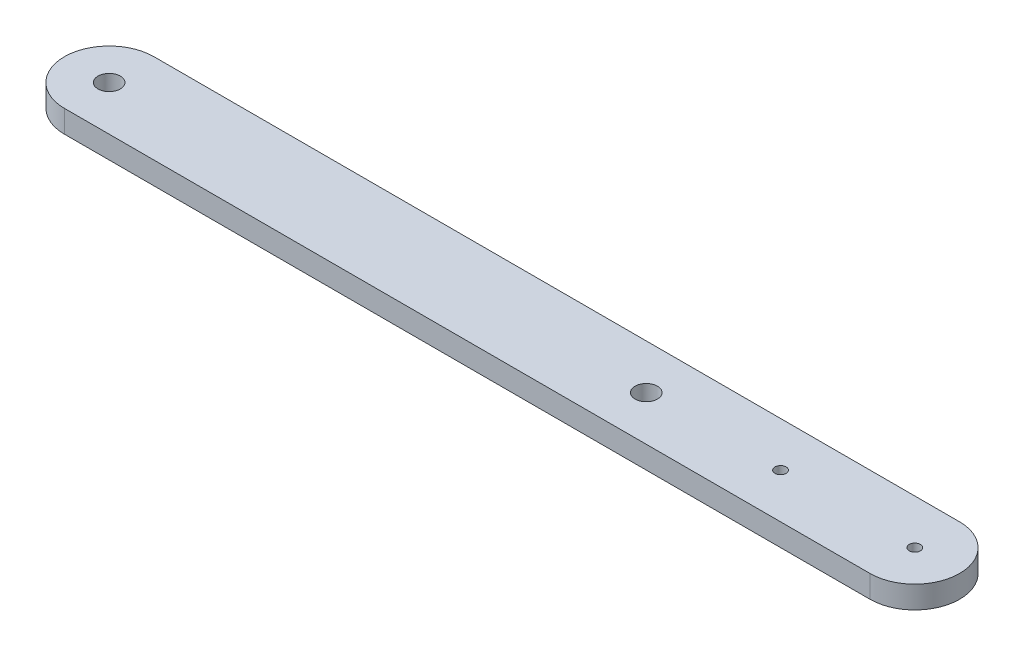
ISO-10303-21;
HEADER;
FILE_DESCRIPTION(('STEP AP214'),'2;1');
FILE_NAME('part.step','',(''),(''),'','','');
FILE_SCHEMA(('AUTOMOTIVE_DESIGN { 1 0 10303 214 1 1 1 1 }'));
ENDSEC;
DATA;
#1=APPLICATION_CONTEXT('core data for automotive mechanical design processes');
#2=APPLICATION_PROTOCOL_DEFINITION('international standard','automotive_design',2000,#1);
#3=PRODUCT_CONTEXT('',#1,'mechanical');
#4=PRODUCT('Part','Part','',(#3));
#5=PRODUCT_RELATED_PRODUCT_CATEGORY('part','',(#4));
#6=PRODUCT_DEFINITION_FORMATION('','',#4);
#7=PRODUCT_DEFINITION_CONTEXT('part definition',#1,'design');
#8=PRODUCT_DEFINITION('design','',#6,#7);
#9=PRODUCT_DEFINITION_SHAPE('','',#8);
#10=(LENGTH_UNIT() NAMED_UNIT(*) SI_UNIT(.MILLI.,.METRE.));
#11=(NAMED_UNIT(*) PLANE_ANGLE_UNIT() SI_UNIT($,.RADIAN.));
#12=(NAMED_UNIT(*) SI_UNIT($,.STERADIAN.) SOLID_ANGLE_UNIT());
#13=UNCERTAINTY_MEASURE_WITH_UNIT(LENGTH_MEASURE(1.E-05),#10,'distance_accuracy_value','');
#14=(GEOMETRIC_REPRESENTATION_CONTEXT(3) GLOBAL_UNCERTAINTY_ASSIGNED_CONTEXT((#13)) GLOBAL_UNIT_ASSIGNED_CONTEXT((#10,
#11,#12)) REPRESENTATION_CONTEXT('',''));
#15=CARTESIAN_POINT('',(0.,0.,0.));
#16=DIRECTION('',(0.,0.,1.));
#17=DIRECTION('',(1.,0.,0.));
#18=AXIS2_PLACEMENT_3D('',#15,#16,#17);
#19=CARTESIAN_POINT('',(0.,6.35,0.));
#20=DIRECTION('',(0.,-1.,0.));
#21=DIRECTION('',(0.,0.,-1.));
#22=AXIS2_PLACEMENT_3D('',#19,#20,#21);
#23=CYLINDRICAL_SURFACE('',#22,12.7);
#24=CARTESIAN_POINT('',(0.,0.,0.));
#25=DIRECTION('',(0.,1.,0.));
#26=DIRECTION('',(0.,0.,1.));
#27=AXIS2_PLACEMENT_3D('',#24,#25,#26);
#28=CIRCLE('',#27,12.7);
#29=CARTESIAN_POINT('',(0.,0.,-12.7));
#30=VERTEX_POINT('',#29);
#31=CARTESIAN_POINT('',(0.,0.,12.7));
#32=VERTEX_POINT('',#31);
#33=EDGE_CURVE('E105',#30,#32,#28,.T.);
#34=ORIENTED_EDGE('',*,*,#33,.T.);
#35=DIRECTION('',(0.,-1.,0.));
#36=VECTOR('',#35,1.);
#37=CARTESIAN_POINT('',(0.,6.35,12.7));
#38=LINE('',#37,#36);
#39=CARTESIAN_POINT('',(0.,6.35,12.7));
#40=VERTEX_POINT('',#39);
#41=EDGE_CURVE('E11',#40,#32,#38,.T.);
#42=ORIENTED_EDGE('',*,*,#41,.F.);
#43=CARTESIAN_POINT('',(0.,6.35,0.));
#44=DIRECTION('',(0.,1.,0.));
#45=DIRECTION('',(0.,0.,1.));
#46=AXIS2_PLACEMENT_3D('',#43,#44,#45);
#47=CIRCLE('',#46,12.7);
#48=CARTESIAN_POINT('',(0.,6.35,-12.7));
#49=VERTEX_POINT('',#48);
#50=EDGE_CURVE('E85',#49,#40,#47,.T.);
#51=ORIENTED_EDGE('',*,*,#50,.F.);
#52=DIRECTION('',(0.,-1.,0.));
#53=VECTOR('',#52,1.);
#54=CARTESIAN_POINT('',(0.,6.35,-12.7));
#55=LINE('',#54,#53);
#56=EDGE_CURVE('E51',#49,#30,#55,.T.);
#57=ORIENTED_EDGE('',*,*,#56,.T.);
#58=EDGE_LOOP('',(#34,#42,#51,#57));
#59=FACE_BOUND('',#58,.T.);
#60=ADVANCED_FACE('F34',(#59),#23,.T.);
#61=CARTESIAN_POINT('',(0.,6.35,12.7));
#62=DIRECTION('',(0.,0.,-1.));
#63=DIRECTION('',(-1.,0.,0.));
#64=AXIS2_PLACEMENT_3D('',#61,#62,#63);
#65=PLANE('',#64);
#66=DIRECTION('',(1.,0.,0.));
#67=VECTOR('',#66,1.);
#68=CARTESIAN_POINT('',(0.,0.,12.7));
#69=LINE('',#68,#67);
#70=CARTESIAN_POINT('',(228.6,0.,12.7));
#71=VERTEX_POINT('',#70);
#72=EDGE_CURVE('E90',#32,#71,#69,.T.);
#73=ORIENTED_EDGE('',*,*,#72,.T.);
#74=DIRECTION('',(0.,-1.,0.));
#75=VECTOR('',#74,1.);
#76=CARTESIAN_POINT('',(228.6,6.35,12.7));
#77=LINE('',#76,#75);
#78=CARTESIAN_POINT('',(228.6,6.35,12.7));
#79=VERTEX_POINT('',#78);
#80=EDGE_CURVE('E43',#79,#71,#77,.T.);
#81=ORIENTED_EDGE('',*,*,#80,.F.);
#82=DIRECTION('',(1.,0.,0.));
#83=VECTOR('',#82,1.);
#84=CARTESIAN_POINT('',(0.,6.35,12.7));
#85=LINE('',#84,#83);
#86=EDGE_CURVE('E77',#40,#79,#85,.T.);
#87=ORIENTED_EDGE('',*,*,#86,.F.);
#88=ORIENTED_EDGE('',*,*,#41,.T.);
#89=EDGE_LOOP('',(#73,#81,#87,#88));
#90=FACE_BOUND('',#89,.T.);
#91=ADVANCED_FACE('F89',(#90),#65,.F.);
#92=CARTESIAN_POINT('',(228.6,6.35,0.));
#93=DIRECTION('',(0.,-1.,0.));
#94=DIRECTION('',(0.,0.,-1.));
#95=AXIS2_PLACEMENT_3D('',#92,#93,#94);
#96=CYLINDRICAL_SURFACE('',#95,12.7);
#97=CARTESIAN_POINT('',(228.6,0.,0.));
#98=DIRECTION('',(0.,1.,0.));
#99=DIRECTION('',(0.,0.,1.));
#100=AXIS2_PLACEMENT_3D('',#97,#98,#99);
#101=CIRCLE('',#100,12.7);
#102=CARTESIAN_POINT('',(228.6,0.,-12.7));
#103=VERTEX_POINT('',#102);
#104=EDGE_CURVE('E109',#71,#103,#101,.T.);
#105=ORIENTED_EDGE('',*,*,#104,.T.);
#106=DIRECTION('',(0.,-1.,0.));
#107=VECTOR('',#106,1.);
#108=CARTESIAN_POINT('',(228.6,6.35,-12.7));
#109=LINE('',#108,#107);
#110=CARTESIAN_POINT('',(228.6,6.35,-12.7));
#111=VERTEX_POINT('',#110);
#112=EDGE_CURVE('E66',#111,#103,#109,.T.);
#113=ORIENTED_EDGE('',*,*,#112,.F.);
#114=CARTESIAN_POINT('',(228.6,6.35,0.));
#115=DIRECTION('',(0.,1.,0.));
#116=DIRECTION('',(0.,0.,1.));
#117=AXIS2_PLACEMENT_3D('',#114,#115,#116);
#118=CIRCLE('',#117,12.7);
#119=EDGE_CURVE('E84',#79,#111,#118,.T.);
#120=ORIENTED_EDGE('',*,*,#119,.F.);
#121=ORIENTED_EDGE('',*,*,#80,.T.);
#122=EDGE_LOOP('',(#105,#113,#120,#121));
#123=FACE_BOUND('',#122,.T.);
#124=ADVANCED_FACE('F93',(#123),#96,.T.);
#125=CARTESIAN_POINT('',(0.,6.35,-12.7));
#126=DIRECTION('',(0.,0.,-1.));
#127=DIRECTION('',(-1.,0.,0.));
#128=AXIS2_PLACEMENT_3D('',#125,#126,#127);
#129=PLANE('',#128);
#130=DIRECTION('',(1.,0.,0.));
#131=VECTOR('',#130,1.);
#132=CARTESIAN_POINT('',(0.,0.,-12.7));
#133=LINE('',#132,#131);
#134=EDGE_CURVE('E111',#30,#103,#133,.T.);
#135=ORIENTED_EDGE('',*,*,#134,.F.);
#136=ORIENTED_EDGE('',*,*,#56,.F.);
#137=DIRECTION('',(1.,0.,0.));
#138=VECTOR('',#137,1.);
#139=CARTESIAN_POINT('',(0.,6.35,-12.7));
#140=LINE('',#139,#138);
#141=EDGE_CURVE('E94',#49,#111,#140,.T.);
#142=ORIENTED_EDGE('',*,*,#141,.T.);
#143=ORIENTED_EDGE('',*,*,#112,.T.);
#144=EDGE_LOOP('',(#135,#136,#142,#143));
#145=FACE_BOUND('',#144,.T.);
#146=ADVANCED_FACE('F171',(#145),#129,.T.);
#147=CARTESIAN_POINT('',(0.,6.35,0.));
#148=DIRECTION('',(0.,-1.,0.));
#149=DIRECTION('',(0.,0.,-1.));
#150=AXIS2_PLACEMENT_3D('',#147,#148,#149);
#151=CYLINDRICAL_SURFACE('',#150,3.175);
#152=CARTESIAN_POINT('',(0.,6.35,0.));
#153=DIRECTION('',(0.,1.,0.));
#154=DIRECTION('',(0.,0.,1.));
#155=AXIS2_PLACEMENT_3D('',#152,#153,#154);
#156=CIRCLE('',#155,3.175);
#157=CARTESIAN_POINT('',(0.,6.35,3.175));
#158=VERTEX_POINT('',#157);
#159=EDGE_CURVE('E117',#158,#158,#156,.T.);
#160=ORIENTED_EDGE('',*,*,#159,.T.);
#161=EDGE_LOOP('',(#160));
#162=FACE_BOUND('',#161,.T.);
#163=CARTESIAN_POINT('',(0.,0.,0.));
#164=DIRECTION('',(0.,1.,0.));
#165=DIRECTION('',(0.,0.,1.));
#166=AXIS2_PLACEMENT_3D('',#163,#164,#165);
#167=CIRCLE('',#166,3.175);
#168=CARTESIAN_POINT('',(0.,0.,3.175));
#169=VERTEX_POINT('',#168);
#170=EDGE_CURVE('E102',#169,#169,#167,.T.);
#171=ORIENTED_EDGE('',*,*,#170,.F.);
#172=EDGE_LOOP('',(#171));
#173=FACE_BOUND('',#172,.T.);
#174=ADVANCED_FACE('F36',(#162,#173),#151,.F.);
#175=CARTESIAN_POINT('',(228.6,6.35,0.));
#176=DIRECTION('',(0.,-1.,0.));
#177=DIRECTION('',(0.,0.,-1.));
#178=AXIS2_PLACEMENT_3D('',#175,#176,#177);
#179=CYLINDRICAL_SURFACE('',#178,1.58749999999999);
#180=CARTESIAN_POINT('',(228.6,6.35,0.));
#181=DIRECTION('',(0.,1.,0.));
#182=DIRECTION('',(0.,0.,1.));
#183=AXIS2_PLACEMENT_3D('',#180,#181,#182);
#184=CIRCLE('',#183,1.58749999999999);
#185=CARTESIAN_POINT('',(228.6,6.35,1.58749999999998));
#186=VERTEX_POINT('',#185);
#187=EDGE_CURVE('E96',#186,#186,#184,.T.);
#188=ORIENTED_EDGE('',*,*,#187,.T.);
#189=EDGE_LOOP('',(#188));
#190=FACE_BOUND('',#189,.T.);
#191=CARTESIAN_POINT('',(228.6,0.,0.));
#192=DIRECTION('',(0.,1.,0.));
#193=DIRECTION('',(0.,0.,1.));
#194=AXIS2_PLACEMENT_3D('',#191,#192,#193);
#195=CIRCLE('',#194,1.58749999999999);
#196=CARTESIAN_POINT('',(228.6,0.,1.58749999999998));
#197=VERTEX_POINT('',#196);
#198=EDGE_CURVE('E114',#197,#197,#195,.T.);
#199=ORIENTED_EDGE('',*,*,#198,.F.);
#200=EDGE_LOOP('',(#199));
#201=FACE_BOUND('',#200,.T.);
#202=ADVANCED_FACE('F150',(#190,#201),#179,.F.);
#203=CARTESIAN_POINT('',(0.,6.35,0.));
#204=DIRECTION('',(0.,1.,0.));
#205=DIRECTION('',(0.,0.,1.));
#206=AXIS2_PLACEMENT_3D('',#203,#204,#205);
#207=PLANE('',#206);
#208=CARTESIAN_POINT('',(152.4,6.35,0.));
#209=DIRECTION('',(0.,1.,0.));
#210=DIRECTION('',(0.,0.,1.));
#211=AXIS2_PLACEMENT_3D('',#208,#209,#210);
#212=CIRCLE('',#211,3.175);
#213=CARTESIAN_POINT('',(152.4,6.35,3.175));
#214=VERTEX_POINT('',#213);
#215=EDGE_CURVE('E132',#214,#214,#212,.T.);
#216=ORIENTED_EDGE('',*,*,#215,.F.);
#217=EDGE_LOOP('',(#216));
#218=FACE_BOUND('',#217,.T.);
#219=CARTESIAN_POINT('',(190.5,6.35,0.));
#220=DIRECTION('',(0.,1.,0.));
#221=DIRECTION('',(0.,0.,1.));
#222=AXIS2_PLACEMENT_3D('',#219,#220,#221);
#223=CIRCLE('',#222,1.58749999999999);
#224=CARTESIAN_POINT('',(190.5,6.35,1.58749999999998));
#225=VERTEX_POINT('',#224);
#226=EDGE_CURVE('E126',#225,#225,#223,.T.);
#227=ORIENTED_EDGE('',*,*,#226,.F.);
#228=EDGE_LOOP('',(#227));
#229=FACE_BOUND('',#228,.T.);
#230=ORIENTED_EDGE('',*,*,#159,.F.);
#231=EDGE_LOOP('',(#230));
#232=FACE_BOUND('',#231,.T.);
#233=ORIENTED_EDGE('',*,*,#50,.T.);
#234=ORIENTED_EDGE('',*,*,#86,.T.);
#235=ORIENTED_EDGE('',*,*,#119,.T.);
#236=ORIENTED_EDGE('',*,*,#141,.F.);
#237=EDGE_LOOP('',(#233,#234,#235,#236));
#238=FACE_BOUND('',#237,.T.);
#239=ORIENTED_EDGE('',*,*,#187,.F.);
#240=EDGE_LOOP('',(#239));
#241=FACE_BOUND('',#240,.T.);
#242=ADVANCED_FACE('F80',(#218,#229,#232,#238,#241),#207,.T.);
#243=CARTESIAN_POINT('',(0.,0.,0.));
#244=DIRECTION('',(0.,1.,0.));
#245=DIRECTION('',(0.,0.,1.));
#246=AXIS2_PLACEMENT_3D('',#243,#244,#245);
#247=PLANE('',#246);
#248=CARTESIAN_POINT('',(152.4,0.,0.));
#249=DIRECTION('',(0.,1.,0.));
#250=DIRECTION('',(0.,0.,1.));
#251=AXIS2_PLACEMENT_3D('',#248,#249,#250);
#252=CIRCLE('',#251,3.175);
#253=CARTESIAN_POINT('',(152.4,0.,3.175));
#254=VERTEX_POINT('',#253);
#255=EDGE_CURVE('E106',#254,#254,#252,.T.);
#256=ORIENTED_EDGE('',*,*,#255,.T.);
#257=EDGE_LOOP('',(#256));
#258=FACE_BOUND('',#257,.T.);
#259=CARTESIAN_POINT('',(190.5,0.,0.));
#260=DIRECTION('',(0.,1.,0.));
#261=DIRECTION('',(0.,0.,1.));
#262=AXIS2_PLACEMENT_3D('',#259,#260,#261);
#263=CIRCLE('',#262,1.58749999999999);
#264=CARTESIAN_POINT('',(190.5,0.,1.58749999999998));
#265=VERTEX_POINT('',#264);
#266=EDGE_CURVE('E129',#265,#265,#263,.T.);
#267=ORIENTED_EDGE('',*,*,#266,.T.);
#268=EDGE_LOOP('',(#267));
#269=FACE_BOUND('',#268,.T.);
#270=ORIENTED_EDGE('',*,*,#170,.T.);
#271=EDGE_LOOP('',(#270));
#272=FACE_BOUND('',#271,.T.);
#273=ORIENTED_EDGE('',*,*,#33,.F.);
#274=ORIENTED_EDGE('',*,*,#134,.T.);
#275=ORIENTED_EDGE('',*,*,#104,.F.);
#276=ORIENTED_EDGE('',*,*,#72,.F.);
#277=EDGE_LOOP('',(#273,#274,#275,#276));
#278=FACE_BOUND('',#277,.T.);
#279=ORIENTED_EDGE('',*,*,#198,.T.);
#280=EDGE_LOOP('',(#279));
#281=FACE_BOUND('',#280,.T.);
#282=ADVANCED_FACE('F138',(#258,#269,#272,#278,#281),#247,.F.);
#283=CARTESIAN_POINT('',(190.5,0.,0.));
#284=DIRECTION('',(0.,1.,0.));
#285=DIRECTION('',(0.,0.,1.));
#286=AXIS2_PLACEMENT_3D('',#283,#284,#285);
#287=CYLINDRICAL_SURFACE('',#286,1.58749999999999);
#288=ORIENTED_EDGE('',*,*,#266,.F.);
#289=EDGE_LOOP('',(#288));
#290=FACE_BOUND('',#289,.T.);
#291=ORIENTED_EDGE('',*,*,#226,.T.);
#292=EDGE_LOOP('',(#291));
#293=FACE_BOUND('',#292,.T.);
#294=ADVANCED_FACE('F144',(#290,#293),#287,.F.);
#295=CARTESIAN_POINT('',(152.4,0.,0.));
#296=DIRECTION('',(0.,1.,0.));
#297=DIRECTION('',(0.,0.,1.));
#298=AXIS2_PLACEMENT_3D('',#295,#296,#297);
#299=CYLINDRICAL_SURFACE('',#298,3.175);
#300=ORIENTED_EDGE('',*,*,#255,.F.);
#301=EDGE_LOOP('',(#300));
#302=FACE_BOUND('',#301,.T.);
#303=ORIENTED_EDGE('',*,*,#215,.T.);
#304=EDGE_LOOP('',(#303));
#305=FACE_BOUND('',#304,.T.);
#306=ADVANCED_FACE('F141',(#302,#305),#299,.F.);
#307=CLOSED_SHELL('',(#60,#91,#124,#146,#174,#202,#242,#282,#294,#306));
#308=MANIFOLD_SOLID_BREP('B2',#307);
#309=ADVANCED_BREP_SHAPE_REPRESENTATION('',(#18,#308),#14);
#310=SHAPE_DEFINITION_REPRESENTATION(#9,#309);
ENDSEC;
END-ISO-10303-21;
